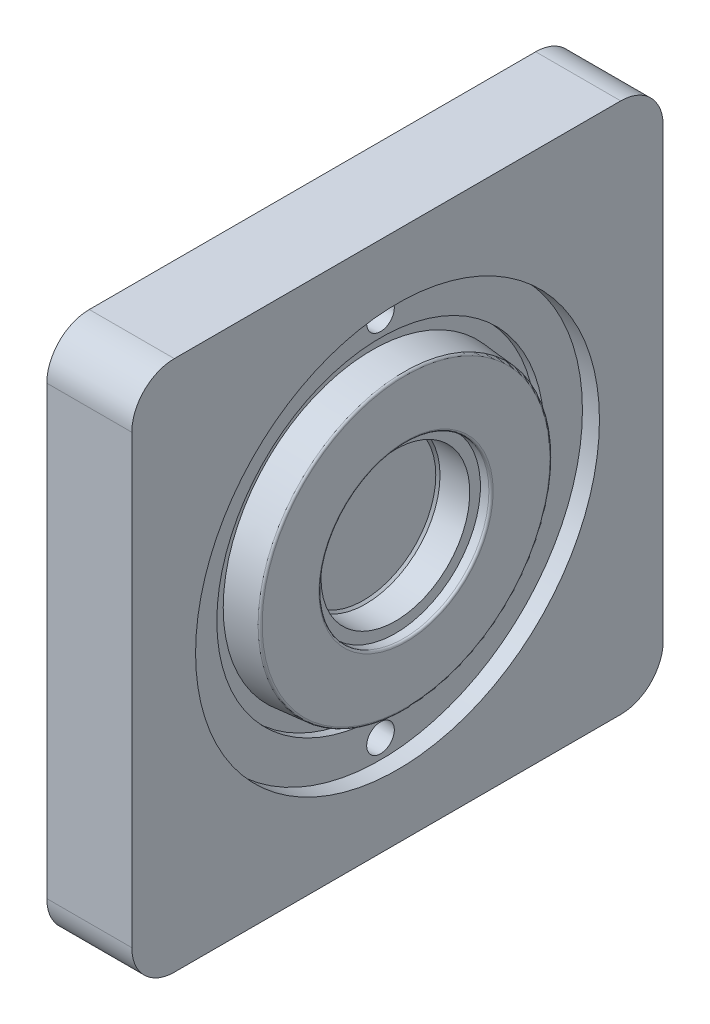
ISO-10303-21;
HEADER;
FILE_DESCRIPTION(('STEP AP214'),'2;1');
FILE_NAME('part.step','',(''),(''),'','','');
FILE_SCHEMA(('AUTOMOTIVE_DESIGN { 1 0 10303 214 1 1 1 1 }'));
ENDSEC;
DATA;
#1=APPLICATION_CONTEXT('core data for automotive mechanical design processes');
#2=APPLICATION_PROTOCOL_DEFINITION('international standard','automotive_design',2000,#1);
#3=PRODUCT_CONTEXT('',#1,'mechanical');
#4=PRODUCT('Part','Part','',(#3));
#5=PRODUCT_RELATED_PRODUCT_CATEGORY('part','',(#4));
#6=PRODUCT_DEFINITION_FORMATION('','',#4);
#7=PRODUCT_DEFINITION_CONTEXT('part definition',#1,'design');
#8=PRODUCT_DEFINITION('design','',#6,#7);
#9=PRODUCT_DEFINITION_SHAPE('','',#8);
#10=(LENGTH_UNIT() NAMED_UNIT(*) SI_UNIT(.MILLI.,.METRE.));
#11=(NAMED_UNIT(*) PLANE_ANGLE_UNIT() SI_UNIT($,.RADIAN.));
#12=(NAMED_UNIT(*) SI_UNIT($,.STERADIAN.) SOLID_ANGLE_UNIT());
#13=UNCERTAINTY_MEASURE_WITH_UNIT(LENGTH_MEASURE(1.E-05),#10,'distance_accuracy_value','');
#14=(GEOMETRIC_REPRESENTATION_CONTEXT(3) GLOBAL_UNCERTAINTY_ASSIGNED_CONTEXT((#13)) GLOBAL_UNIT_ASSIGNED_CONTEXT((#10,
#11,#12)) REPRESENTATION_CONTEXT('',''));
#15=CARTESIAN_POINT('',(0.,0.,0.));
#16=DIRECTION('',(0.,0.,1.));
#17=DIRECTION('',(1.,0.,0.));
#18=AXIS2_PLACEMENT_3D('',#15,#16,#17);
#19=CARTESIAN_POINT('',(-24.,0.,0.));
#20=DIRECTION('',(-1.,0.,0.));
#21=DIRECTION('',(0.,-1.,0.));
#22=AXIS2_PLACEMENT_3D('',#19,#20,#21);
#23=PLANE('',#22);
#24=CARTESIAN_POINT('',(-23.9999999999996,86.,0.));
#25=DIRECTION('',(-1.,0.,0.));
#26=DIRECTION('',(0.,-1.,0.));
#27=AXIS2_PLACEMENT_3D('',#24,#25,#26);
#28=CIRCLE('',#27,9.29963723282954);
#29=CARTESIAN_POINT('',(-23.9999999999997,76.7003627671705,0.));
#30=VERTEX_POINT('',#29);
#31=EDGE_CURVE('E185',#30,#30,#28,.F.);
#32=ORIENTED_EDGE('',*,*,#31,.T.);
#33=EDGE_LOOP('',(#32));
#34=FACE_BOUND('',#33,.T.);
#35=CARTESIAN_POINT('',(-24.0000000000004,-86.,0.));
#36=DIRECTION('',(-1.,0.,0.));
#37=DIRECTION('',(0.,-1.,0.));
#38=AXIS2_PLACEMENT_3D('',#35,#36,#37);
#39=CIRCLE('',#38,9.29963723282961);
#40=CARTESIAN_POINT('',(-24.0000000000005,-95.2996372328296,0.));
#41=VERTEX_POINT('',#40);
#42=EDGE_CURVE('E231',#41,#41,#39,.F.);
#43=ORIENTED_EDGE('',*,*,#42,.T.);
#44=EDGE_LOOP('',(#43));
#45=FACE_BOUND('',#44,.T.);
#46=DIRECTION('',(0.,0.,1.));
#47=VECTOR('',#46,1.);
#48=CARTESIAN_POINT('',(-24.0000000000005,-125.,125.));
#49=LINE('',#48,#47);
#50=CARTESIAN_POINT('',(-24.0000000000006,-125.,-105.));
#51=VERTEX_POINT('',#50);
#52=CARTESIAN_POINT('',(-24.0000000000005,-125.,105.));
#53=VERTEX_POINT('',#52);
#54=EDGE_CURVE('E121',#51,#53,#49,.T.);
#55=ORIENTED_EDGE('',*,*,#54,.T.);
#56=CARTESIAN_POINT('',(-24.0000000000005,-105.,105.));
#57=DIRECTION('',(-1.,0.,0.));
#58=DIRECTION('',(0.,-1.,0.));
#59=AXIS2_PLACEMENT_3D('',#56,#57,#58);
#60=CIRCLE('',#59,20.);
#61=CARTESIAN_POINT('',(-24.0000000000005,-105.,125.));
#62=VERTEX_POINT('',#61);
#63=EDGE_CURVE('E168',#53,#62,#60,.T.);
#64=ORIENTED_EDGE('',*,*,#63,.T.);
#65=DIRECTION('',(0.,1.,0.));
#66=VECTOR('',#65,1.);
#67=CARTESIAN_POINT('',(-24.0000000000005,-125.,125.));
#68=LINE('',#67,#66);
#69=CARTESIAN_POINT('',(-23.9999999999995,105.,125.));
#70=VERTEX_POINT('',#69);
#71=EDGE_CURVE('E178',#62,#70,#68,.T.);
#72=ORIENTED_EDGE('',*,*,#71,.T.);
#73=CARTESIAN_POINT('',(-23.9999999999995,105.,105.));
#74=DIRECTION('',(-1.,0.,0.));
#75=DIRECTION('',(0.,-1.,0.));
#76=AXIS2_PLACEMENT_3D('',#73,#74,#75);
#77=CIRCLE('',#76,20.);
#78=CARTESIAN_POINT('',(-23.9999999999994,125.,105.));
#79=VERTEX_POINT('',#78);
#80=EDGE_CURVE('E174',#70,#79,#77,.T.);
#81=ORIENTED_EDGE('',*,*,#80,.T.);
#82=DIRECTION('',(0.,0.,-1.));
#83=VECTOR('',#82,1.);
#84=CARTESIAN_POINT('',(-23.9999999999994,125.,125.));
#85=LINE('',#84,#83);
#86=CARTESIAN_POINT('',(-23.9999999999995,125.,-105.));
#87=VERTEX_POINT('',#86);
#88=EDGE_CURVE('E132',#79,#87,#85,.T.);
#89=ORIENTED_EDGE('',*,*,#88,.T.);
#90=CARTESIAN_POINT('',(-23.9999999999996,105.,-105.));
#91=DIRECTION('',(-1.,0.,0.));
#92=DIRECTION('',(0.,-1.,0.));
#93=AXIS2_PLACEMENT_3D('',#90,#91,#92);
#94=CIRCLE('',#93,20.);
#95=CARTESIAN_POINT('',(-23.9999999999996,105.,-125.));
#96=VERTEX_POINT('',#95);
#97=EDGE_CURVE('E172',#87,#96,#94,.T.);
#98=ORIENTED_EDGE('',*,*,#97,.T.);
#99=DIRECTION('',(0.,-1.,0.));
#100=VECTOR('',#99,1.);
#101=CARTESIAN_POINT('',(-24.0000000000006,-125.,-125.));
#102=LINE('',#101,#100);
#103=CARTESIAN_POINT('',(-24.0000000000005,-105.,-125.));
#104=VERTEX_POINT('',#103);
#105=EDGE_CURVE('E182',#96,#104,#102,.T.);
#106=ORIENTED_EDGE('',*,*,#105,.T.);
#107=CARTESIAN_POINT('',(-24.0000000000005,-105.,-105.));
#108=DIRECTION('',(-1.,0.,0.));
#109=DIRECTION('',(0.,-1.,0.));
#110=AXIS2_PLACEMENT_3D('',#107,#108,#109);
#111=CIRCLE('',#110,20.);
#112=EDGE_CURVE('E170',#104,#51,#111,.T.);
#113=ORIENTED_EDGE('',*,*,#112,.T.);
#114=EDGE_LOOP('',(#55,#64,#72,#81,#89,#98,#106,#113));
#115=FACE_BOUND('',#114,.T.);
#116=ADVANCED_FACE('F47',(#34,#45,#115),#23,.T.);
#117=CARTESIAN_POINT('',(105.999999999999,-125.,125.));
#118=DIRECTION('',(0.,-1.,0.));
#119=DIRECTION('',(0.,0.,-1.));
#120=AXIS2_PLACEMENT_3D('',#117,#118,#119);
#121=PLANE('',#120);
#122=DIRECTION('',(0.,0.,1.));
#123=VECTOR('',#122,1.);
#124=CARTESIAN_POINT('',(15.9999999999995,-125.,125.));
#125=LINE('',#124,#123);
#126=CARTESIAN_POINT('',(15.9999999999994,-125.,-105.));
#127=VERTEX_POINT('',#126);
#128=CARTESIAN_POINT('',(15.9999999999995,-125.,105.));
#129=VERTEX_POINT('',#128);
#130=EDGE_CURVE('E118',#127,#129,#125,.T.);
#131=ORIENTED_EDGE('',*,*,#130,.T.);
#132=DIRECTION('',(-1.,0.,0.));
#133=VECTOR('',#132,1.);
#134=CARTESIAN_POINT('',(105.999999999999,-125.,105.));
#135=LINE('',#134,#133);
#136=EDGE_CURVE('E123',#129,#53,#135,.T.);
#137=ORIENTED_EDGE('',*,*,#136,.T.);
#138=ORIENTED_EDGE('',*,*,#54,.F.);
#139=DIRECTION('',(-1.,0.,0.));
#140=VECTOR('',#139,1.);
#141=CARTESIAN_POINT('',(105.999999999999,-125.,-105.));
#142=LINE('',#141,#140);
#143=EDGE_CURVE('E115',#51,#127,#142,.F.);
#144=ORIENTED_EDGE('',*,*,#143,.T.);
#145=EDGE_LOOP('',(#131,#137,#138,#144));
#146=FACE_BOUND('',#145,.T.);
#147=ADVANCED_FACE('F116',(#146),#121,.T.);
#148=CARTESIAN_POINT('',(105.999999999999,-125.,125.));
#149=DIRECTION('',(0.,0.,1.));
#150=DIRECTION('',(1.,0.,0.));
#151=AXIS2_PLACEMENT_3D('',#148,#149,#150);
#152=PLANE('',#151);
#153=ORIENTED_EDGE('',*,*,#71,.F.);
#154=DIRECTION('',(-1.,0.,0.));
#155=VECTOR('',#154,1.);
#156=CARTESIAN_POINT('',(105.999999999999,-105.,125.));
#157=LINE('',#156,#155);
#158=CARTESIAN_POINT('',(15.9999999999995,-105.,125.));
#159=VERTEX_POINT('',#158);
#160=EDGE_CURVE('E164',#62,#159,#157,.F.);
#161=ORIENTED_EDGE('',*,*,#160,.T.);
#162=DIRECTION('',(0.,1.,0.));
#163=VECTOR('',#162,1.);
#164=CARTESIAN_POINT('',(15.9999999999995,-125.,125.));
#165=LINE('',#164,#163);
#166=CARTESIAN_POINT('',(16.0000000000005,105.,125.));
#167=VERTEX_POINT('',#166);
#168=EDGE_CURVE('E131',#159,#167,#165,.T.);
#169=ORIENTED_EDGE('',*,*,#168,.T.);
#170=DIRECTION('',(-1.,0.,0.));
#171=VECTOR('',#170,1.);
#172=CARTESIAN_POINT('',(105.999999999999,105.,125.));
#173=LINE('',#172,#171);
#174=EDGE_CURVE('E163',#167,#70,#173,.T.);
#175=ORIENTED_EDGE('',*,*,#174,.T.);
#176=EDGE_LOOP('',(#153,#161,#169,#175));
#177=FACE_BOUND('',#176,.T.);
#178=ADVANCED_FACE('F266',(#177),#152,.T.);
#179=CARTESIAN_POINT('',(106.000000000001,125.,125.));
#180=DIRECTION('',(0.,1.,0.));
#181=DIRECTION('',(0.,0.,1.));
#182=AXIS2_PLACEMENT_3D('',#179,#180,#181);
#183=PLANE('',#182);
#184=DIRECTION('',(0.,0.,-1.));
#185=VECTOR('',#184,1.);
#186=CARTESIAN_POINT('',(16.0000000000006,125.,125.));
#187=LINE('',#186,#185);
#188=CARTESIAN_POINT('',(16.0000000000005,125.,105.));
#189=VERTEX_POINT('',#188);
#190=CARTESIAN_POINT('',(16.0000000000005,125.,-105.));
#191=VERTEX_POINT('',#190);
#192=EDGE_CURVE('E152',#189,#191,#187,.T.);
#193=ORIENTED_EDGE('',*,*,#192,.T.);
#194=DIRECTION('',(-1.,0.,0.));
#195=VECTOR('',#194,1.);
#196=CARTESIAN_POINT('',(106.000000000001,125.,-105.));
#197=LINE('',#196,#195);
#198=EDGE_CURVE('E11',#191,#87,#197,.T.);
#199=ORIENTED_EDGE('',*,*,#198,.T.);
#200=ORIENTED_EDGE('',*,*,#88,.F.);
#201=DIRECTION('',(-1.,0.,0.));
#202=VECTOR('',#201,1.);
#203=CARTESIAN_POINT('',(106.000000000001,125.,105.));
#204=LINE('',#203,#202);
#205=EDGE_CURVE('E55',#79,#189,#204,.F.);
#206=ORIENTED_EDGE('',*,*,#205,.T.);
#207=EDGE_LOOP('',(#193,#199,#200,#206));
#208=FACE_BOUND('',#207,.T.);
#209=ADVANCED_FACE('F151',(#208),#183,.T.);
#210=CARTESIAN_POINT('',(105.999999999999,-125.,-125.));
#211=DIRECTION('',(0.,0.,-1.));
#212=DIRECTION('',(-1.,0.,0.));
#213=AXIS2_PLACEMENT_3D('',#210,#211,#212);
#214=PLANE('',#213);
#215=DIRECTION('',(0.,-1.,0.));
#216=VECTOR('',#215,1.);
#217=CARTESIAN_POINT('',(15.9999999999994,-125.,-125.));
#218=LINE('',#217,#216);
#219=CARTESIAN_POINT('',(16.0000000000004,105.,-125.));
#220=VERTEX_POINT('',#219);
#221=CARTESIAN_POINT('',(15.9999999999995,-105.,-125.));
#222=VERTEX_POINT('',#221);
#223=EDGE_CURVE('E159',#220,#222,#218,.T.);
#224=ORIENTED_EDGE('',*,*,#223,.T.);
#225=DIRECTION('',(-1.,0.,0.));
#226=VECTOR('',#225,1.);
#227=CARTESIAN_POINT('',(105.999999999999,-105.,-125.));
#228=LINE('',#227,#226);
#229=EDGE_CURVE('E137',#222,#104,#228,.T.);
#230=ORIENTED_EDGE('',*,*,#229,.T.);
#231=ORIENTED_EDGE('',*,*,#105,.F.);
#232=DIRECTION('',(-1.,0.,0.));
#233=VECTOR('',#232,1.);
#234=CARTESIAN_POINT('',(105.999999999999,105.,-125.));
#235=LINE('',#234,#233);
#236=EDGE_CURVE('E69',#96,#220,#235,.F.);
#237=ORIENTED_EDGE('',*,*,#236,.T.);
#238=EDGE_LOOP('',(#224,#230,#231,#237));
#239=FACE_BOUND('',#238,.T.);
#240=ADVANCED_FACE('F274',(#239),#214,.T.);
#241=CARTESIAN_POINT('',(8.,0.,0.));
#242=DIRECTION('',(-1.,0.,0.));
#243=DIRECTION('',(0.,0.,1.));
#244=AXIS2_PLACEMENT_3D('',#241,#242,#243);
#245=PLANE('',#244);
#246=CARTESIAN_POINT('',(8.00000000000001,86.,0.));
#247=DIRECTION('',(1.,0.,0.));
#248=DIRECTION('',(0.,0.,-1.));
#249=AXIS2_PLACEMENT_3D('',#246,#247,#248);
#250=CIRCLE('',#249,6.5);
#251=CARTESIAN_POINT('',(8.00000000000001,86.,-6.5));
#252=VERTEX_POINT('',#251);
#253=EDGE_CURVE('E237',#252,#252,#250,.F.);
#254=ORIENTED_EDGE('',*,*,#253,.T.);
#255=EDGE_LOOP('',(#254));
#256=FACE_BOUND('',#255,.T.);
#257=CARTESIAN_POINT('',(8.00000000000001,-86.,0.));
#258=DIRECTION('',(1.,0.,0.));
#259=DIRECTION('',(0.,0.,-1.));
#260=AXIS2_PLACEMENT_3D('',#257,#258,#259);
#261=CIRCLE('',#260,6.5);
#262=CARTESIAN_POINT('',(8.00000000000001,-86.,-6.5));
#263=VERTEX_POINT('',#262);
#264=EDGE_CURVE('E234',#263,#263,#261,.F.);
#265=ORIENTED_EDGE('',*,*,#264,.T.);
#266=EDGE_LOOP('',(#265));
#267=FACE_BOUND('',#266,.T.);
#268=CARTESIAN_POINT('',(8.,0.,0.));
#269=DIRECTION('',(-1.,0.,0.));
#270=DIRECTION('',(0.,0.,1.));
#271=AXIS2_PLACEMENT_3D('',#268,#269,#270);
#272=CIRCLE('',#271,77.);
#273=CARTESIAN_POINT('',(8.,0.,77.));
#274=VERTEX_POINT('',#273);
#275=EDGE_CURVE('E186',#274,#274,#272,.T.);
#276=ORIENTED_EDGE('',*,*,#275,.T.);
#277=EDGE_LOOP('',(#276));
#278=FACE_BOUND('',#277,.T.);
#279=CARTESIAN_POINT('',(8.,0.,0.));
#280=DIRECTION('',(-1.,0.,0.));
#281=DIRECTION('',(0.,0.,1.));
#282=AXIS2_PLACEMENT_3D('',#279,#280,#281);
#283=CIRCLE('',#282,95.);
#284=CARTESIAN_POINT('',(8.,0.,95.));
#285=VERTEX_POINT('',#284);
#286=EDGE_CURVE('E199',#285,#285,#283,.T.);
#287=ORIENTED_EDGE('',*,*,#286,.F.);
#288=EDGE_LOOP('',(#287));
#289=FACE_BOUND('',#288,.T.);
#290=ADVANCED_FACE('F241',(#256,#267,#278,#289),#245,.F.);
#291=CARTESIAN_POINT('',(0.,22.5,0.));
#292=DIRECTION('',(1.,0.,0.));
#293=DIRECTION('',(0.,0.,-1.));
#294=AXIS2_PLACEMENT_3D('',#291,#292,#293);
#295=PLANE('',#294);
#296=CARTESIAN_POINT('',(0.,0.,0.));
#297=DIRECTION('',(1.,0.,0.));
#298=DIRECTION('',(0.,0.,-1.));
#299=AXIS2_PLACEMENT_3D('',#296,#297,#298);
#300=CIRCLE('',#299,34.0000000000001);
#301=CARTESIAN_POINT('',(0.,0.,-34.0000000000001));
#302=VERTEX_POINT('',#301);
#303=EDGE_CURVE('E195',#302,#302,#300,.F.);
#304=ORIENTED_EDGE('',*,*,#303,.F.);
#305=EDGE_LOOP('',(#304));
#306=FACE_BOUND('',#305,.T.);
#307=ADVANCED_FACE('F366',(#306),#295,.T.);
#308=CARTESIAN_POINT('',(0.,0.,0.));
#309=DIRECTION('',(1.,0.,0.));
#310=DIRECTION('',(0.,0.,-1.));
#311=AXIS2_PLACEMENT_3D('',#308,#309,#310);
#312=CONICAL_SURFACE('',#311,34.0000000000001,0.785398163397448);
#313=CARTESIAN_POINT('',(0.999999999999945,0.,0.));
#314=DIRECTION('',(1.,0.,0.));
#315=DIRECTION('',(0.,0.,-1.));
#316=AXIS2_PLACEMENT_3D('',#313,#314,#315);
#317=CIRCLE('',#316,35.);
#318=CARTESIAN_POINT('',(0.999999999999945,0.,-35.));
#319=VERTEX_POINT('',#318);
#320=EDGE_CURVE('E198',#319,#319,#317,.T.);
#321=ORIENTED_EDGE('',*,*,#320,.T.);
#322=EDGE_LOOP('',(#321));
#323=FACE_BOUND('',#322,.T.);
#324=ORIENTED_EDGE('',*,*,#303,.T.);
#325=EDGE_LOOP('',(#324));
#326=FACE_BOUND('',#325,.T.);
#327=ADVANCED_FACE('F371',(#323,#326),#312,.F.);
#328=CARTESIAN_POINT('',(0.,0.,0.));
#329=DIRECTION('',(-1.,0.,0.));
#330=DIRECTION('',(0.,0.,1.));
#331=AXIS2_PLACEMENT_3D('',#328,#329,#330);
#332=CYLINDRICAL_SURFACE('',#331,35.);
#333=ORIENTED_EDGE('',*,*,#320,.F.);
#334=EDGE_LOOP('',(#333));
#335=FACE_BOUND('',#334,.T.);
#336=CARTESIAN_POINT('',(15.,0.,0.));
#337=DIRECTION('',(-1.,0.,0.));
#338=DIRECTION('',(0.,0.,1.));
#339=AXIS2_PLACEMENT_3D('',#336,#337,#338);
#340=CIRCLE('',#339,35.);
#341=CARTESIAN_POINT('',(15.,0.,35.));
#342=VERTEX_POINT('',#341);
#343=EDGE_CURVE('E202',#342,#342,#340,.T.);
#344=ORIENTED_EDGE('',*,*,#343,.F.);
#345=EDGE_LOOP('',(#344));
#346=FACE_BOUND('',#345,.T.);
#347=ADVANCED_FACE('F481',(#335,#346),#332,.F.);
#348=CARTESIAN_POINT('',(15.,35.,0.));
#349=DIRECTION('',(1.,0.,0.));
#350=DIRECTION('',(0.,0.,-1.));
#351=AXIS2_PLACEMENT_3D('',#348,#349,#350);
#352=PLANE('',#351);
#353=ORIENTED_EDGE('',*,*,#343,.T.);
#354=EDGE_LOOP('',(#353));
#355=FACE_BOUND('',#354,.T.);
#356=CARTESIAN_POINT('',(15.,0.,0.));
#357=DIRECTION('',(-1.,0.,0.));
#358=DIRECTION('',(0.,0.,1.));
#359=AXIS2_PLACEMENT_3D('',#356,#357,#358);
#360=CIRCLE('',#359,40.);
#361=CARTESIAN_POINT('',(15.,0.,40.));
#362=VERTEX_POINT('',#361);
#363=EDGE_CURVE('E205',#362,#362,#360,.T.);
#364=ORIENTED_EDGE('',*,*,#363,.F.);
#365=EDGE_LOOP('',(#364));
#366=FACE_BOUND('',#365,.T.);
#367=ADVANCED_FACE('F469',(#355,#366),#352,.T.);
#368=CARTESIAN_POINT('',(0.,0.,0.));
#369=DIRECTION('',(-1.,0.,0.));
#370=DIRECTION('',(0.,0.,1.));
#371=AXIS2_PLACEMENT_3D('',#368,#369,#370);
#372=CYLINDRICAL_SURFACE('',#371,40.);
#373=CARTESIAN_POINT('',(19.,0.,0.));
#374=DIRECTION('',(1.,0.,0.));
#375=DIRECTION('',(0.,0.,-1.));
#376=AXIS2_PLACEMENT_3D('',#373,#374,#375);
#377=CIRCLE('',#376,40.);
#378=CARTESIAN_POINT('',(19.,0.,-40.));
#379=VERTEX_POINT('',#378);
#380=EDGE_CURVE('E208',#379,#379,#377,.F.);
#381=ORIENTED_EDGE('',*,*,#380,.F.);
#382=EDGE_LOOP('',(#381));
#383=FACE_BOUND('',#382,.T.);
#384=ORIENTED_EDGE('',*,*,#363,.T.);
#385=EDGE_LOOP('',(#384));
#386=FACE_BOUND('',#385,.T.);
#387=ADVANCED_FACE('F457',(#383,#386),#372,.F.);
#388=CARTESIAN_POINT('',(19.,0.,0.));
#389=DIRECTION('',(1.,0.,0.));
#390=DIRECTION('',(0.,0.,-1.));
#391=AXIS2_PLACEMENT_3D('',#388,#389,#390);
#392=TOROIDAL_SURFACE('',#391,41.,1.);
#393=CARTESIAN_POINT('',(20.,0.,0.));
#394=DIRECTION('',(1.,0.,0.));
#395=DIRECTION('',(0.,0.,-1.));
#396=AXIS2_PLACEMENT_3D('',#393,#394,#395);
#397=CIRCLE('',#396,41.);
#398=CARTESIAN_POINT('',(20.,0.,-41.));
#399=VERTEX_POINT('',#398);
#400=EDGE_CURVE('E211',#399,#399,#397,.T.);
#401=ORIENTED_EDGE('',*,*,#400,.T.);
#402=EDGE_LOOP('',(#401));
#403=FACE_BOUND('',#402,.T.);
#404=ORIENTED_EDGE('',*,*,#380,.T.);
#405=EDGE_LOOP('',(#404));
#406=FACE_BOUND('',#405,.T.);
#407=ADVANCED_FACE('F445',(#403,#406),#392,.T.);
#408=CARTESIAN_POINT('',(20.,40.,0.));
#409=DIRECTION('',(1.,0.,0.));
#410=DIRECTION('',(0.,0.,-1.));
#411=AXIS2_PLACEMENT_3D('',#408,#409,#410);
#412=PLANE('',#411);
#413=ORIENTED_EDGE('',*,*,#400,.F.);
#414=EDGE_LOOP('',(#413));
#415=FACE_BOUND('',#414,.T.);
#416=CARTESIAN_POINT('',(20.,0.,0.));
#417=DIRECTION('',(1.,0.,0.));
#418=DIRECTION('',(0.,0.,-1.));
#419=AXIS2_PLACEMENT_3D('',#416,#417,#418);
#420=CIRCLE('',#419,67.6838502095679);
#421=CARTESIAN_POINT('',(20.,0.,-67.6838502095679));
#422=VERTEX_POINT('',#421);
#423=EDGE_CURVE('E214',#422,#422,#420,.F.);
#424=ORIENTED_EDGE('',*,*,#423,.F.);
#425=EDGE_LOOP('',(#424));
#426=FACE_BOUND('',#425,.T.);
#427=ADVANCED_FACE('F433',(#415,#426),#412,.T.);
#428=CARTESIAN_POINT('',(19.,0.,0.));
#429=DIRECTION('',(1.,0.,0.));
#430=DIRECTION('',(0.,0.,-1.));
#431=AXIS2_PLACEMENT_3D('',#428,#429,#430);
#432=TOROIDAL_SURFACE('',#431,67.6838502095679,1.);
#433=CARTESIAN_POINT('',(19.0871557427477,0.,0.));
#434=DIRECTION('',(-1.,0.,0.));
#435=DIRECTION('',(0.,0.,1.));
#436=AXIS2_PLACEMENT_3D('',#433,#434,#435);
#437=CIRCLE('',#436,68.6800449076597);
#438=CARTESIAN_POINT('',(19.0871557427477,0.,68.6800449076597));
#439=VERTEX_POINT('',#438);
#440=EDGE_CURVE('E217',#439,#439,#437,.F.);
#441=ORIENTED_EDGE('',*,*,#440,.T.);
#442=EDGE_LOOP('',(#441));
#443=FACE_BOUND('',#442,.T.);
#444=ORIENTED_EDGE('',*,*,#423,.T.);
#445=EDGE_LOOP('',(#444));
#446=FACE_BOUND('',#445,.T.);
#447=ADVANCED_FACE('F421',(#443,#446),#432,.T.);
#448=CARTESIAN_POINT('',(4.,0.,0.));
#449=DIRECTION('',(-1.,0.,0.));
#450=DIRECTION('',(0.,0.,1.));
#451=AXIS2_PLACEMENT_3D('',#448,#449,#450);
#452=CONICAL_SURFACE('',#451,70.,0.0872664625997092);
#453=ORIENTED_EDGE('',*,*,#440,.F.);
#454=EDGE_LOOP('',(#453));
#455=FACE_BOUND('',#454,.T.);
#456=CARTESIAN_POINT('',(4.,0.,0.));
#457=DIRECTION('',(-1.,0.,0.));
#458=DIRECTION('',(0.,0.,1.));
#459=AXIS2_PLACEMENT_3D('',#456,#457,#458);
#460=CIRCLE('',#459,70.);
#461=CARTESIAN_POINT('',(4.,0.,70.));
#462=VERTEX_POINT('',#461);
#463=EDGE_CURVE('E220',#462,#462,#460,.T.);
#464=ORIENTED_EDGE('',*,*,#463,.F.);
#465=EDGE_LOOP('',(#464));
#466=FACE_BOUND('',#465,.T.);
#467=ADVANCED_FACE('F409',(#455,#466),#452,.T.);
#468=CARTESIAN_POINT('',(4.,70.,0.));
#469=DIRECTION('',(1.,0.,0.));
#470=DIRECTION('',(0.,0.,-1.));
#471=AXIS2_PLACEMENT_3D('',#468,#469,#470);
#472=PLANE('',#471);
#473=ORIENTED_EDGE('',*,*,#463,.T.);
#474=EDGE_LOOP('',(#473));
#475=FACE_BOUND('',#474,.T.);
#476=CARTESIAN_POINT('',(4.,0.,0.));
#477=DIRECTION('',(-1.,0.,0.));
#478=DIRECTION('',(0.,0.,1.));
#479=AXIS2_PLACEMENT_3D('',#476,#477,#478);
#480=CIRCLE('',#479,77.);
#481=CARTESIAN_POINT('',(4.,0.,77.));
#482=VERTEX_POINT('',#481);
#483=EDGE_CURVE('E194',#482,#482,#480,.T.);
#484=ORIENTED_EDGE('',*,*,#483,.F.);
#485=EDGE_LOOP('',(#484));
#486=FACE_BOUND('',#485,.T.);
#487=ADVANCED_FACE('F397',(#475,#486),#472,.T.);
#488=CARTESIAN_POINT('',(0.,0.,0.));
#489=DIRECTION('',(-1.,0.,0.));
#490=DIRECTION('',(0.,0.,1.));
#491=AXIS2_PLACEMENT_3D('',#488,#489,#490);
#492=CYLINDRICAL_SURFACE('',#491,77.);
#493=ORIENTED_EDGE('',*,*,#483,.T.);
#494=EDGE_LOOP('',(#493));
#495=FACE_BOUND('',#494,.T.);
#496=ORIENTED_EDGE('',*,*,#275,.F.);
#497=EDGE_LOOP('',(#496));
#498=FACE_BOUND('',#497,.T.);
#499=ADVANCED_FACE('F385',(#495,#498),#492,.F.);
#500=CARTESIAN_POINT('',(0.,0.,0.));
#501=DIRECTION('',(-1.,0.,0.));
#502=DIRECTION('',(0.,0.,1.));
#503=AXIS2_PLACEMENT_3D('',#500,#501,#502);
#504=CYLINDRICAL_SURFACE('',#503,95.);
#505=ORIENTED_EDGE('',*,*,#286,.T.);
#506=EDGE_LOOP('',(#505));
#507=FACE_BOUND('',#506,.T.);
#508=CARTESIAN_POINT('',(16.,0.,0.));
#509=DIRECTION('',(-1.,0.,0.));
#510=DIRECTION('',(0.,0.,1.));
#511=AXIS2_PLACEMENT_3D('',#508,#509,#510);
#512=CIRCLE('',#511,95.);
#513=CARTESIAN_POINT('',(16.,0.,95.));
#514=VERTEX_POINT('',#513);
#515=EDGE_CURVE('E124',#514,#514,#512,.T.);
#516=ORIENTED_EDGE('',*,*,#515,.F.);
#517=EDGE_LOOP('',(#516));
#518=FACE_BOUND('',#517,.T.);
#519=ADVANCED_FACE('F318',(#507,#518),#504,.F.);
#520=CARTESIAN_POINT('',(16.,-1.94894889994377,94.9999995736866));
#521=DIRECTION('',(1.,0.,0.));
#522=DIRECTION('',(0.,0.999999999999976,2.18740155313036E-07));
#523=AXIS2_PLACEMENT_3D('',#520,#521,#522);
#524=PLANE('',#523);
#525=ORIENTED_EDGE('',*,*,#168,.F.);
#526=CARTESIAN_POINT('',(15.9999999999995,-105.,105.));
#527=DIRECTION('',(1.,0.,0.));
#528=DIRECTION('',(0.,1.,0.));
#529=AXIS2_PLACEMENT_3D('',#526,#527,#528);
#530=CIRCLE('',#529,20.);
#531=EDGE_CURVE('E130',#159,#129,#530,.T.);
#532=ORIENTED_EDGE('',*,*,#531,.T.);
#533=ORIENTED_EDGE('',*,*,#130,.F.);
#534=CARTESIAN_POINT('',(15.9999999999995,-105.,-105.));
#535=DIRECTION('',(1.,0.,0.));
#536=DIRECTION('',(0.,1.,0.));
#537=AXIS2_PLACEMENT_3D('',#534,#535,#536);
#538=CIRCLE('',#537,20.);
#539=EDGE_CURVE('E62',#127,#222,#538,.T.);
#540=ORIENTED_EDGE('',*,*,#539,.T.);
#541=ORIENTED_EDGE('',*,*,#223,.F.);
#542=CARTESIAN_POINT('',(16.0000000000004,105.,-105.));
#543=DIRECTION('',(1.,0.,0.));
#544=DIRECTION('',(0.,1.,0.));
#545=AXIS2_PLACEMENT_3D('',#542,#543,#544);
#546=CIRCLE('',#545,20.);
#547=EDGE_CURVE('E138',#220,#191,#546,.T.);
#548=ORIENTED_EDGE('',*,*,#547,.T.);
#549=ORIENTED_EDGE('',*,*,#192,.F.);
#550=CARTESIAN_POINT('',(16.0000000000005,105.,105.));
#551=DIRECTION('',(1.,0.,0.));
#552=DIRECTION('',(0.,1.,0.));
#553=AXIS2_PLACEMENT_3D('',#550,#551,#552);
#554=CIRCLE('',#553,20.);
#555=EDGE_CURVE('E141',#189,#167,#554,.T.);
#556=ORIENTED_EDGE('',*,*,#555,.T.);
#557=EDGE_LOOP('',(#525,#532,#533,#540,#541,#548,#549,#556));
#558=FACE_BOUND('',#557,.T.);
#559=ORIENTED_EDGE('',*,*,#515,.T.);
#560=EDGE_LOOP('',(#559));
#561=FACE_BOUND('',#560,.T.);
#562=ADVANCED_FACE('F127',(#558,#561),#524,.T.);
#563=CARTESIAN_POINT('',(8.00000000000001,-86.,0.));
#564=DIRECTION('',(-1.,0.,0.));
#565=DIRECTION('',(0.,0.,-1.));
#566=AXIS2_PLACEMENT_3D('',#563,#564,#565);
#567=CONICAL_SURFACE('',#566,6.5,0.0872664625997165);
#568=ORIENTED_EDGE('',*,*,#42,.F.);
#569=EDGE_LOOP('',(#568));
#570=FACE_BOUND('',#569,.T.);
#571=ORIENTED_EDGE('',*,*,#264,.F.);
#572=EDGE_LOOP('',(#571));
#573=FACE_BOUND('',#572,.T.);
#574=ADVANCED_FACE('F247',(#570,#573),#567,.F.);
#575=CARTESIAN_POINT('',(8.00000000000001,86.,0.));
#576=DIRECTION('',(-1.,0.,0.));
#577=DIRECTION('',(0.,0.,1.));
#578=AXIS2_PLACEMENT_3D('',#575,#576,#577);
#579=CONICAL_SURFACE('',#578,6.5,0.0872664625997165);
#580=ORIENTED_EDGE('',*,*,#31,.F.);
#581=EDGE_LOOP('',(#580));
#582=FACE_BOUND('',#581,.T.);
#583=ORIENTED_EDGE('',*,*,#253,.F.);
#584=EDGE_LOOP('',(#583));
#585=FACE_BOUND('',#584,.T.);
#586=ADVANCED_FACE('F244',(#582,#585),#579,.F.);
#587=CARTESIAN_POINT('',(105.999999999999,-105.,105.));
#588=DIRECTION('',(-1.,0.,0.));
#589=DIRECTION('',(0.,0.,1.));
#590=AXIS2_PLACEMENT_3D('',#587,#588,#589);
#591=CYLINDRICAL_SURFACE('',#590,20.);
#592=ORIENTED_EDGE('',*,*,#531,.F.);
#593=ORIENTED_EDGE('',*,*,#160,.F.);
#594=ORIENTED_EDGE('',*,*,#63,.F.);
#595=ORIENTED_EDGE('',*,*,#136,.F.);
#596=EDGE_LOOP('',(#592,#593,#594,#595));
#597=FACE_BOUND('',#596,.T.);
#598=ADVANCED_FACE('F246',(#597),#591,.T.);
#599=CARTESIAN_POINT('',(105.999999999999,-105.,-105.));
#600=DIRECTION('',(-1.,0.,0.));
#601=DIRECTION('',(0.,0.,1.));
#602=AXIS2_PLACEMENT_3D('',#599,#600,#601);
#603=CYLINDRICAL_SURFACE('',#602,20.);
#604=ORIENTED_EDGE('',*,*,#539,.F.);
#605=ORIENTED_EDGE('',*,*,#143,.F.);
#606=ORIENTED_EDGE('',*,*,#112,.F.);
#607=ORIENTED_EDGE('',*,*,#229,.F.);
#608=EDGE_LOOP('',(#604,#605,#606,#607));
#609=FACE_BOUND('',#608,.T.);
#610=ADVANCED_FACE('F135',(#609),#603,.T.);
#611=CARTESIAN_POINT('',(106.000000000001,105.,-105.));
#612=DIRECTION('',(-1.,0.,0.));
#613=DIRECTION('',(0.,0.,1.));
#614=AXIS2_PLACEMENT_3D('',#611,#612,#613);
#615=CYLINDRICAL_SURFACE('',#614,20.);
#616=ORIENTED_EDGE('',*,*,#547,.F.);
#617=ORIENTED_EDGE('',*,*,#236,.F.);
#618=ORIENTED_EDGE('',*,*,#97,.F.);
#619=ORIENTED_EDGE('',*,*,#198,.F.);
#620=EDGE_LOOP('',(#616,#617,#618,#619));
#621=FACE_BOUND('',#620,.T.);
#622=ADVANCED_FACE('F281',(#621),#615,.T.);
#623=CARTESIAN_POINT('',(105.999999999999,105.,105.));
#624=DIRECTION('',(-1.,0.,0.));
#625=DIRECTION('',(0.,0.,1.));
#626=AXIS2_PLACEMENT_3D('',#623,#624,#625);
#627=CYLINDRICAL_SURFACE('',#626,20.);
#628=ORIENTED_EDGE('',*,*,#555,.F.);
#629=ORIENTED_EDGE('',*,*,#205,.F.);
#630=ORIENTED_EDGE('',*,*,#80,.F.);
#631=ORIENTED_EDGE('',*,*,#174,.F.);
#632=EDGE_LOOP('',(#628,#629,#630,#631));
#633=FACE_BOUND('',#632,.T.);
#634=ADVANCED_FACE('F49',(#633),#627,.T.);
#635=CLOSED_SHELL('',(#116,#147,#178,#209,#240,#290,#307,#327,#347,#367,#387,#407,#427,#447,
#467,#487,#499,#519,#562,#574,#586,#598,#610,#622,#634));
#636=MANIFOLD_SOLID_BREP('B2',#635);
#637=ADVANCED_BREP_SHAPE_REPRESENTATION('',(#18,#636),#14);
#638=SHAPE_DEFINITION_REPRESENTATION(#9,#637);
ENDSEC;
END-ISO-10303-21;
